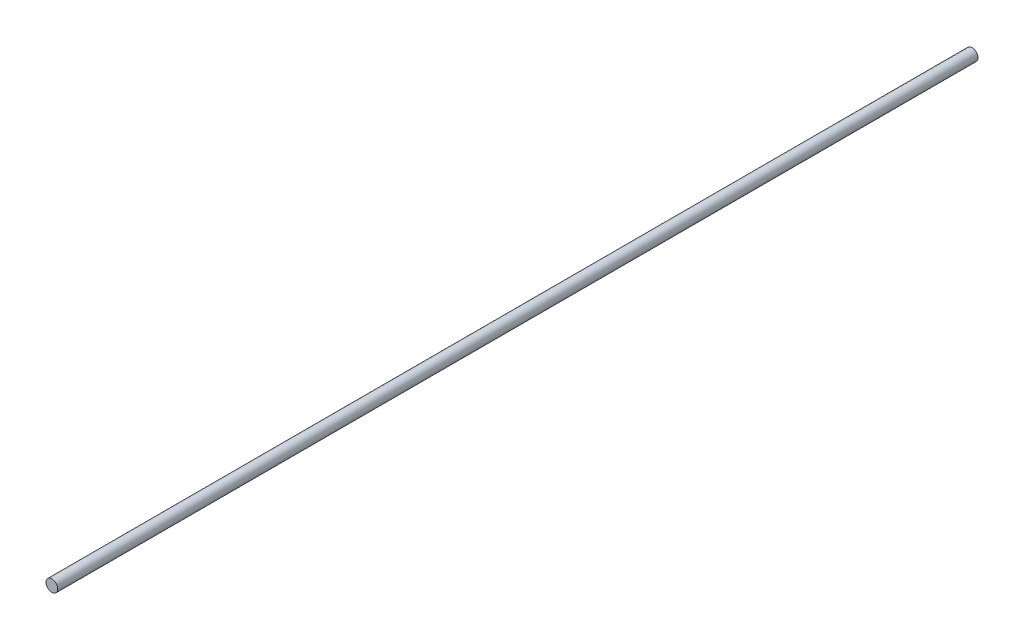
ISO-10303-21;
HEADER;
FILE_DESCRIPTION(('STEP AP214'),'2;1');
FILE_NAME('part.step','',(''),(''),'','','');
FILE_SCHEMA(('AUTOMOTIVE_DESIGN { 1 0 10303 214 1 1 1 1 }'));
ENDSEC;
DATA;
#1=APPLICATION_CONTEXT('core data for automotive mechanical design processes');
#2=APPLICATION_PROTOCOL_DEFINITION('international standard','automotive_design',2000,#1);
#3=PRODUCT_CONTEXT('',#1,'mechanical');
#4=PRODUCT('Part','Part','',(#3));
#5=PRODUCT_RELATED_PRODUCT_CATEGORY('part','',(#4));
#6=PRODUCT_DEFINITION_FORMATION('','',#4);
#7=PRODUCT_DEFINITION_CONTEXT('part definition',#1,'design');
#8=PRODUCT_DEFINITION('design','',#6,#7);
#9=PRODUCT_DEFINITION_SHAPE('','',#8);
#10=(LENGTH_UNIT() NAMED_UNIT(*) SI_UNIT(.MILLI.,.METRE.));
#11=(NAMED_UNIT(*) PLANE_ANGLE_UNIT() SI_UNIT($,.RADIAN.));
#12=(NAMED_UNIT(*) SI_UNIT($,.STERADIAN.) SOLID_ANGLE_UNIT());
#13=UNCERTAINTY_MEASURE_WITH_UNIT(LENGTH_MEASURE(1.E-05),#10,'distance_accuracy_value','');
#14=(GEOMETRIC_REPRESENTATION_CONTEXT(3) GLOBAL_UNCERTAINTY_ASSIGNED_CONTEXT((#13)) GLOBAL_UNIT_ASSIGNED_CONTEXT((#10,
#11,#12)) REPRESENTATION_CONTEXT('',''));
#15=CARTESIAN_POINT('',(0.,0.,0.));
#16=DIRECTION('',(0.,0.,1.));
#17=DIRECTION('',(1.,0.,0.));
#18=AXIS2_PLACEMENT_3D('',#15,#16,#17);
#19=CARTESIAN_POINT('',(0.,0.,-4700.));
#20=DIRECTION('',(0.,0.,1.));
#21=DIRECTION('',(1.,0.,0.));
#22=AXIS2_PLACEMENT_3D('',#19,#20,#21);
#23=CYLINDRICAL_SURFACE('',#22,30.);
#24=CARTESIAN_POINT('',(0.,0.,-4700.));
#25=DIRECTION('',(0.,0.,1.));
#26=DIRECTION('',(1.,0.,0.));
#27=AXIS2_PLACEMENT_3D('',#24,#25,#26);
#28=CIRCLE('',#27,30.);
#29=CARTESIAN_POINT('',(30.,0.,-4700.));
#30=VERTEX_POINT('',#29);
#31=EDGE_CURVE('E10',#30,#30,#28,.T.);
#32=ORIENTED_EDGE('',*,*,#31,.T.);
#33=EDGE_LOOP('',(#32));
#34=FACE_BOUND('',#33,.T.);
#35=CARTESIAN_POINT('',(0.,0.,0.));
#36=DIRECTION('',(0.,0.,1.));
#37=DIRECTION('',(1.,0.,0.));
#38=AXIS2_PLACEMENT_3D('',#35,#36,#37);
#39=CIRCLE('',#38,30.);
#40=CARTESIAN_POINT('',(30.,0.,0.));
#41=VERTEX_POINT('',#40);
#42=EDGE_CURVE('E40',#41,#41,#39,.T.);
#43=ORIENTED_EDGE('',*,*,#42,.F.);
#44=EDGE_LOOP('',(#43));
#45=FACE_BOUND('',#44,.T.);
#46=ADVANCED_FACE('F37',(#34,#45),#23,.T.);
#47=CARTESIAN_POINT('',(0.,0.,-4700.));
#48=DIRECTION('',(0.,0.,1.));
#49=DIRECTION('',(1.,0.,0.));
#50=AXIS2_PLACEMENT_3D('',#47,#48,#49);
#51=PLANE('',#50);
#52=ORIENTED_EDGE('',*,*,#31,.F.);
#53=EDGE_LOOP('',(#52));
#54=FACE_BOUND('',#53,.T.);
#55=ADVANCED_FACE('F54',(#54),#51,.F.);
#56=CARTESIAN_POINT('',(0.,0.,0.));
#57=DIRECTION('',(0.,0.,1.));
#58=DIRECTION('',(1.,0.,0.));
#59=AXIS2_PLACEMENT_3D('',#56,#57,#58);
#60=PLANE('',#59);
#61=ORIENTED_EDGE('',*,*,#42,.T.);
#62=EDGE_LOOP('',(#61));
#63=FACE_BOUND('',#62,.T.);
#64=ADVANCED_FACE('F51',(#63),#60,.T.);
#65=CLOSED_SHELL('',(#46,#55,#64));
#66=MANIFOLD_SOLID_BREP('B2',#65);
#67=ADVANCED_BREP_SHAPE_REPRESENTATION('',(#18,#66),#14);
#68=SHAPE_DEFINITION_REPRESENTATION(#9,#67);
ENDSEC;
END-ISO-10303-21;
